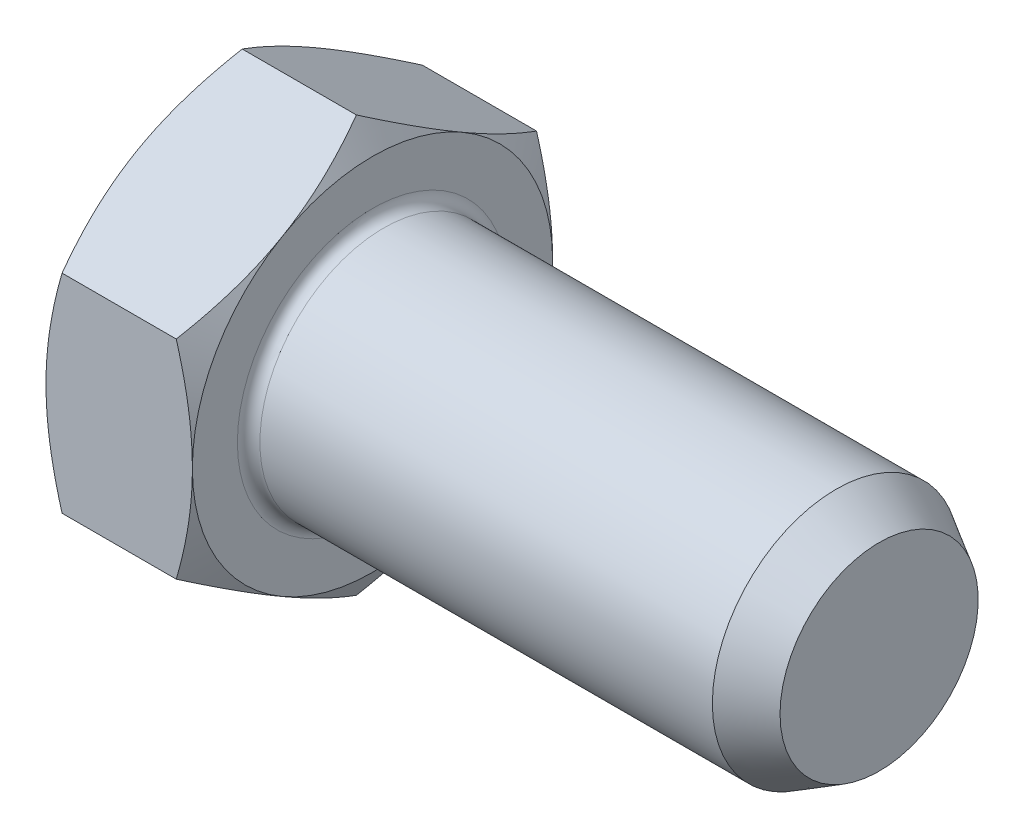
from build123d import *

# Parameters (mm, degrees)
EXTRUDE1_DEPTH = 1.3
SKETCH4_W      = 0.6
SKETCH4_H      = 1.28
CHAMFER1_SIZE  = 0.22
CHAMFER1_SIZE2 = 0.381051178
FILLET1_R      = 0.1


with BuildPart() as part:
    # Sketch1 → Revolve1 (revolve)
    with BuildSketch(Plane.XY, mode=Mode.PRIVATE) as revolve1_sk:
        Polygon((0, 0), (0, 1.4), (1.3, 1.4), (1.3, 1.1), (5.8, 1.1), (5.8, 0), align=None)
    revolve(revolve1_sk.sketch.rotate(Axis((13.107885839, 0, 0), (-1, 0, 0)), 90), axis=Axis((13.107885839, 0, 0), (-1, 0, 0)))

    # Sketch2 → Extrude1 (add)
    with BuildSketch(Plane.ZY):
        Polygon((1.6, -0.923760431), (1.6, 0.923760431), (0, 1.847520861), (-1.6, 0.923760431), (-1.6, -0.923760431), (0, -1.847520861), align=None)
    extrude(amount=-EXTRUDE1_DEPTH)

    # Sketch3 → Cut-Revolve2 (revolve, cut)
    with BuildSketch(Plane(origin=(0, 0, 0), x_dir=(1, 0, 0), z_dir=(0, 1, 0))):
        Polygon((-0.923760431, 0), (0.65, 2.725833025), (1.3, 1.6), (1.3, 3.225833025), (-1.023760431, 3.225833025), (-1.023760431, 0), align=None)
    revolve(axis=Axis((0, 0, 0), (-1, 0, 0)), mode=Mode.SUBTRACT)

    # Sketch4 → Cut-Revolve3 (revolve, cut)
    with BuildSketch(Plane.XY, mode=Mode.PRIVATE) as cut_revolve3_sk:
        with Locations((0.1, 0.64)):
            Rectangle(SKETCH4_W, SKETCH4_H)
    revolve(cut_revolve3_sk.sketch.rotate(Axis((0, 0, 0), (1, 0, 0)), 180), axis=Axis((0, 0, 0), (1, 0, 0)), mode=Mode.SUBTRACT)

    # Chamfer1
    chamfer1_edges = [part.edges().sort_by_distance(p)[0] for p in [
        (5.8, 0, 1.1),
    ]]
    chamfer1_side = [part.faces().sort_by_distance(p)[0] for p in [
        (5.8, 0, 0),
    ]]
    chamfer(chamfer1_edges, length=CHAMFER1_SIZE, length2=CHAMFER1_SIZE2, reference=chamfer1_side[0])

    # Fillet1
    fillet1_edges = [part.edges().sort_by_distance(p)[0] for p in [
        (1.3, 0, 1.1),
    ]]
    fillet(fillet1_edges, radius=FILLET1_R)


solid = part.part
